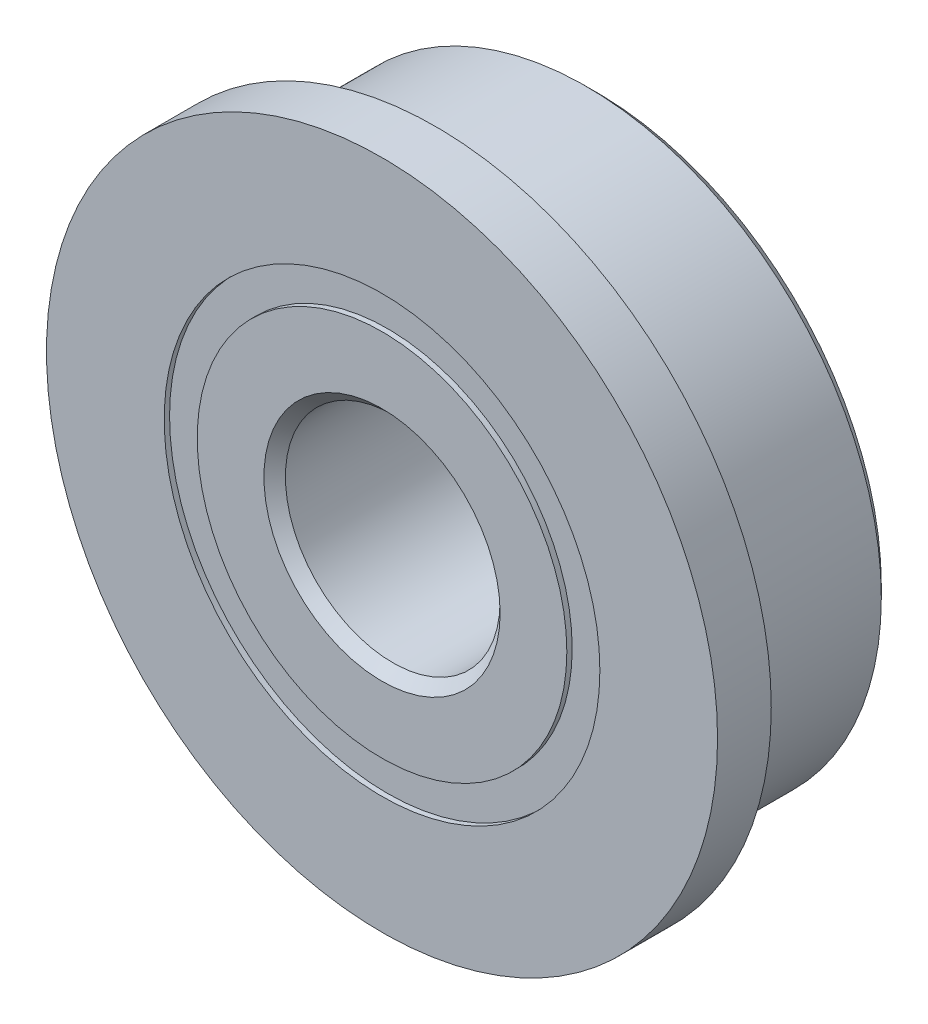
ISO-10303-21;
HEADER;
FILE_DESCRIPTION(('STEP AP214'),'2;1');
FILE_NAME('part.step','',(''),(''),'','','');
FILE_SCHEMA(('AUTOMOTIVE_DESIGN { 1 0 10303 214 1 1 1 1 }'));
ENDSEC;
DATA;
#1=APPLICATION_CONTEXT('core data for automotive mechanical design processes');
#2=APPLICATION_PROTOCOL_DEFINITION('international standard','automotive_design',2000,#1);
#3=PRODUCT_CONTEXT('',#1,'mechanical');
#4=PRODUCT('Part','Part','',(#3));
#5=PRODUCT_RELATED_PRODUCT_CATEGORY('part','',(#4));
#6=PRODUCT_DEFINITION_FORMATION('','',#4);
#7=PRODUCT_DEFINITION_CONTEXT('part definition',#1,'design');
#8=PRODUCT_DEFINITION('design','',#6,#7);
#9=PRODUCT_DEFINITION_SHAPE('','',#8);
#10=(LENGTH_UNIT() NAMED_UNIT(*) SI_UNIT(.MILLI.,.METRE.));
#11=(NAMED_UNIT(*) PLANE_ANGLE_UNIT() SI_UNIT($,.RADIAN.));
#12=(NAMED_UNIT(*) SI_UNIT($,.STERADIAN.) SOLID_ANGLE_UNIT());
#13=UNCERTAINTY_MEASURE_WITH_UNIT(LENGTH_MEASURE(1.E-05),#10,'distance_accuracy_value','');
#14=(GEOMETRIC_REPRESENTATION_CONTEXT(3) GLOBAL_UNCERTAINTY_ASSIGNED_CONTEXT((#13)) GLOBAL_UNIT_ASSIGNED_CONTEXT((#10,
#11,#12)) REPRESENTATION_CONTEXT('',''));
#15=CARTESIAN_POINT('',(0.,0.,0.));
#16=DIRECTION('',(0.,0.,1.));
#17=DIRECTION('',(1.,0.,0.));
#18=AXIS2_PLACEMENT_3D('',#15,#16,#17);
#19=CARTESIAN_POINT('',(0.,4.05769230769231,-1.9));
#20=DIRECTION('',(0.,0.,1.));
#21=DIRECTION('',(1.,0.,0.));
#22=AXIS2_PLACEMENT_3D('',#19,#20,#21);
#23=PLANE('',#22);
#24=CARTESIAN_POINT('',(0.,0.,-1.9));
#25=DIRECTION('',(0.,0.,1.));
#26=DIRECTION('',(1.,0.,0.));
#27=AXIS2_PLACEMENT_3D('',#24,#25,#26);
#28=CIRCLE('',#27,4.05769230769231);
#29=CARTESIAN_POINT('',(4.05769230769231,0.,-1.9));
#30=VERTEX_POINT('',#29);
#31=EDGE_CURVE('E66',#30,#30,#28,.T.);
#32=ORIENTED_EDGE('',*,*,#31,.F.);
#33=EDGE_LOOP('',(#32));
#34=FACE_BOUND('',#33,.T.);
#35=CARTESIAN_POINT('',(0.,0.,-1.9));
#36=DIRECTION('',(0.,0.,1.));
#37=DIRECTION('',(1.,0.,0.));
#38=AXIS2_PLACEMENT_3D('',#35,#36,#37);
#39=CIRCLE('',#38,3.44230769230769);
#40=CARTESIAN_POINT('',(3.44230769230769,0.,-1.9));
#41=VERTEX_POINT('',#40);
#42=EDGE_CURVE('E11',#41,#41,#39,.T.);
#43=ORIENTED_EDGE('',*,*,#42,.T.);
#44=EDGE_LOOP('',(#43));
#45=FACE_BOUND('',#44,.T.);
#46=ADVANCED_FACE('F52',(#34,#45),#23,.F.);
#47=CARTESIAN_POINT('',(0.,0.,2.));
#48=DIRECTION('',(0.,0.,1.));
#49=DIRECTION('',(1.,0.,0.));
#50=AXIS2_PLACEMENT_3D('',#47,#48,#49);
#51=CYLINDRICAL_SURFACE('',#50,3.44230769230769);
#52=ORIENTED_EDGE('',*,*,#42,.F.);
#53=EDGE_LOOP('',(#52));
#54=FACE_BOUND('',#53,.T.);
#55=CARTESIAN_POINT('',(0.,0.,-0.940637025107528));
#56=DIRECTION('',(0.,0.,1.));
#57=DIRECTION('',(1.,0.,0.));
#58=AXIS2_PLACEMENT_3D('',#55,#56,#57);
#59=CIRCLE('',#58,3.44230769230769);
#60=CARTESIAN_POINT('',(3.44230769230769,0.,-0.940637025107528));
#61=VERTEX_POINT('',#60);
#62=EDGE_CURVE('E58',#61,#61,#59,.T.);
#63=ORIENTED_EDGE('',*,*,#62,.T.);
#64=EDGE_LOOP('',(#63));
#65=FACE_BOUND('',#64,.T.);
#66=ADVANCED_FACE('F75',(#54,#65),#51,.F.);
#67=CARTESIAN_POINT('',(0.,4.05769230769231,-0.940637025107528));
#68=DIRECTION('',(0.,0.,-1.));
#69=DIRECTION('',(-1.,0.,0.));
#70=AXIS2_PLACEMENT_3D('',#67,#68,#69);
#71=PLANE('',#70);
#72=ORIENTED_EDGE('',*,*,#62,.F.);
#73=EDGE_LOOP('',(#72));
#74=FACE_BOUND('',#73,.T.);
#75=CARTESIAN_POINT('',(0.,0.,-0.940637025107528));
#76=DIRECTION('',(0.,0.,1.));
#77=DIRECTION('',(1.,0.,0.));
#78=AXIS2_PLACEMENT_3D('',#75,#76,#77);
#79=CIRCLE('',#78,4.05769230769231);
#80=CARTESIAN_POINT('',(4.05769230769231,0.,-0.940637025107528));
#81=VERTEX_POINT('',#80);
#82=EDGE_CURVE('E62',#81,#81,#79,.T.);
#83=ORIENTED_EDGE('',*,*,#82,.T.);
#84=EDGE_LOOP('',(#83));
#85=FACE_BOUND('',#84,.T.);
#86=ADVANCED_FACE('F79',(#74,#85),#71,.F.);
#87=CARTESIAN_POINT('',(0.,0.,2.));
#88=DIRECTION('',(0.,0.,1.));
#89=DIRECTION('',(1.,0.,0.));
#90=AXIS2_PLACEMENT_3D('',#87,#88,#89);
#91=CYLINDRICAL_SURFACE('',#90,4.05769230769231);
#92=ORIENTED_EDGE('',*,*,#82,.F.);
#93=EDGE_LOOP('',(#92));
#94=FACE_BOUND('',#93,.T.);
#95=ORIENTED_EDGE('',*,*,#31,.T.);
#96=EDGE_LOOP('',(#95));
#97=FACE_BOUND('',#96,.T.);
#98=ADVANCED_FACE('F72',(#94,#97),#91,.T.);
#99=CLOSED_SHELL('',(#46,#66,#86,#98));
#100=MANIFOLD_SOLID_BREP('B2',#99);
#101=CARTESIAN_POINT('',(-1.87499999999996,3.24759526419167,0.));
#102=DIRECTION('',(0.,0.,1.));
#103=DIRECTION('',(-0.499999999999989,0.866025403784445,0.));
#104=AXIS2_PLACEMENT_3D('',#101,#102,#103);
#105=SPHERICAL_SURFACE('',#104,0.940637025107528);
#106=CARTESIAN_POINT('',(-1.87499999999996,3.24759526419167,0.940637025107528));
#107=VERTEX_POINT('',#106);
#108=VERTEX_LOOP('',#107);
#109=FACE_BOUND('',#108,.T.);
#110=ADVANCED_FACE('F120',(#109),#105,.T.);
#111=CLOSED_SHELL('',(#110));
#112=MANIFOLD_SOLID_BREP('B6',#111);
#113=CARTESIAN_POINT('',(-3.24759526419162,1.87500000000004,0.));
#114=DIRECTION('',(0.,0.,1.));
#115=DIRECTION('',(-0.866025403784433,0.50000000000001,0.));
#116=AXIS2_PLACEMENT_3D('',#113,#114,#115);
#117=SPHERICAL_SURFACE('',#116,0.940637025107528);
#118=CARTESIAN_POINT('',(-3.24759526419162,1.87500000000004,0.940637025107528));
#119=VERTEX_POINT('',#118);
#120=VERTEX_LOOP('',#119);
#121=FACE_BOUND('',#120,.T.);
#122=ADVANCED_FACE('F145',(#121),#117,.T.);
#123=CLOSED_SHELL('',(#122));
#124=MANIFOLD_SOLID_BREP('B48',#123);
#125=CARTESIAN_POINT('',(-3.75,0.,0.));
#126=DIRECTION('',(0.,0.,1.));
#127=DIRECTION('',(-1.,0.,0.));
#128=AXIS2_PLACEMENT_3D('',#125,#126,#127);
#129=SPHERICAL_SURFACE('',#128,0.940637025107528);
#130=CARTESIAN_POINT('',(-3.75,0.,0.940637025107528));
#131=VERTEX_POINT('',#130);
#132=VERTEX_LOOP('',#131);
#133=FACE_BOUND('',#132,.T.);
#134=ADVANCED_FACE('F170',(#133),#129,.T.);
#135=CLOSED_SHELL('',(#134));
#136=MANIFOLD_SOLID_BREP('B116',#135);
#137=CARTESIAN_POINT('',(-3.24759526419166,-1.87499999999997,0.));
#138=DIRECTION('',(0.,0.,1.));
#139=DIRECTION('',(-0.866025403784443,-0.499999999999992,0.));
#140=AXIS2_PLACEMENT_3D('',#137,#138,#139);
#141=SPHERICAL_SURFACE('',#140,0.940637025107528);
#142=CARTESIAN_POINT('',(-3.24759526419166,-1.87499999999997,0.940637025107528));
#143=VERTEX_POINT('',#142);
#144=VERTEX_LOOP('',#143);
#145=FACE_BOUND('',#144,.T.);
#146=ADVANCED_FACE('F195',(#145),#141,.T.);
#147=CLOSED_SHELL('',(#146));
#148=MANIFOLD_SOLID_BREP('B141',#147);
#149=CARTESIAN_POINT('',(-1.87500000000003,-3.24759526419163,0.));
#150=DIRECTION('',(0.,0.,1.));
#151=DIRECTION('',(-0.500000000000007,-0.866025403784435,0.));
#152=AXIS2_PLACEMENT_3D('',#149,#150,#151);
#153=SPHERICAL_SURFACE('',#152,0.940637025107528);
#154=CARTESIAN_POINT('',(-1.87500000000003,-3.24759526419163,0.940637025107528));
#155=VERTEX_POINT('',#154);
#156=VERTEX_LOOP('',#155);
#157=FACE_BOUND('',#156,.T.);
#158=ADVANCED_FACE('F220',(#157),#153,.T.);
#159=CLOSED_SHELL('',(#158));
#160=MANIFOLD_SOLID_BREP('B166',#159);
#161=CARTESIAN_POINT('',(0.,-3.75,0.));
#162=DIRECTION('',(0.,0.,1.));
#163=DIRECTION('',(0.,-1.,0.));
#164=AXIS2_PLACEMENT_3D('',#161,#162,#163);
#165=SPHERICAL_SURFACE('',#164,0.940637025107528);
#166=CARTESIAN_POINT('',(0.,-3.75,0.940637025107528));
#167=VERTEX_POINT('',#166);
#168=VERTEX_LOOP('',#167);
#169=FACE_BOUND('',#168,.T.);
#170=ADVANCED_FACE('F245',(#169),#165,.T.);
#171=CLOSED_SHELL('',(#170));
#172=MANIFOLD_SOLID_BREP('B191',#171);
#173=CARTESIAN_POINT('',(1.87499999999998,-3.24759526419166,0.));
#174=DIRECTION('',(0.,0.,1.));
#175=DIRECTION('',(0.499999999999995,-0.866025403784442,0.));
#176=AXIS2_PLACEMENT_3D('',#173,#174,#175);
#177=SPHERICAL_SURFACE('',#176,0.940637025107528);
#178=CARTESIAN_POINT('',(1.87499999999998,-3.24759526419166,0.940637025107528));
#179=VERTEX_POINT('',#178);
#180=VERTEX_LOOP('',#179);
#181=FACE_BOUND('',#180,.T.);
#182=ADVANCED_FACE('F270',(#181),#177,.T.);
#183=CLOSED_SHELL('',(#182));
#184=MANIFOLD_SOLID_BREP('B216',#183);
#185=CARTESIAN_POINT('',(3.24759526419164,-1.87500000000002,0.));
#186=DIRECTION('',(0.,0.,1.));
#187=DIRECTION('',(0.866025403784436,-0.500000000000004,0.));
#188=AXIS2_PLACEMENT_3D('',#185,#186,#187);
#189=SPHERICAL_SURFACE('',#188,0.940637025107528);
#190=CARTESIAN_POINT('',(3.24759526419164,-1.87500000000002,0.940637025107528));
#191=VERTEX_POINT('',#190);
#192=VERTEX_LOOP('',#191);
#193=FACE_BOUND('',#192,.T.);
#194=ADVANCED_FACE('F295',(#193),#189,.T.);
#195=CLOSED_SHELL('',(#194));
#196=MANIFOLD_SOLID_BREP('B241',#195);
#197=CARTESIAN_POINT('',(3.75,0.,0.));
#198=DIRECTION('',(0.,0.,1.));
#199=DIRECTION('',(1.,0.,0.));
#200=AXIS2_PLACEMENT_3D('',#197,#198,#199);
#201=SPHERICAL_SURFACE('',#200,0.940637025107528);
#202=CARTESIAN_POINT('',(3.75,0.,0.940637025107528));
#203=VERTEX_POINT('',#202);
#204=VERTEX_LOOP('',#203);
#205=FACE_BOUND('',#204,.T.);
#206=ADVANCED_FACE('F320',(#205),#201,.T.);
#207=CLOSED_SHELL('',(#206));
#208=MANIFOLD_SOLID_BREP('B266',#207);
#209=CARTESIAN_POINT('',(3.24759526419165,1.87499999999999,0.));
#210=DIRECTION('',(0.,0.,1.));
#211=DIRECTION('',(0.86602540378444,0.499999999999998,0.));
#212=AXIS2_PLACEMENT_3D('',#209,#210,#211);
#213=SPHERICAL_SURFACE('',#212,0.940637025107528);
#214=CARTESIAN_POINT('',(3.24759526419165,1.87499999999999,0.940637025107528));
#215=VERTEX_POINT('',#214);
#216=VERTEX_LOOP('',#215);
#217=FACE_BOUND('',#216,.T.);
#218=ADVANCED_FACE('F345',(#217),#213,.T.);
#219=CLOSED_SHELL('',(#218));
#220=MANIFOLD_SOLID_BREP('B291',#219);
#221=CARTESIAN_POINT('',(1.875,3.24759526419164,0.));
#222=DIRECTION('',(0.,0.,1.));
#223=DIRECTION('',(0.500000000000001,0.866025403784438,0.));
#224=AXIS2_PLACEMENT_3D('',#221,#222,#223);
#225=SPHERICAL_SURFACE('',#224,0.940637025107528);
#226=CARTESIAN_POINT('',(1.875,3.24759526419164,0.940637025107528));
#227=VERTEX_POINT('',#226);
#228=VERTEX_LOOP('',#227);
#229=FACE_BOUND('',#228,.T.);
#230=ADVANCED_FACE('F370',(#229),#225,.T.);
#231=CLOSED_SHELL('',(#230));
#232=MANIFOLD_SOLID_BREP('B316',#231);
#233=CARTESIAN_POINT('',(0.,3.75,0.));
#234=DIRECTION('',(0.,0.,1.));
#235=DIRECTION('',(0.,1.,0.));
#236=AXIS2_PLACEMENT_3D('',#233,#234,#235);
#237=SPHERICAL_SURFACE('',#236,0.940637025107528);
#238=CARTESIAN_POINT('',(0.,3.75,0.940637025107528));
#239=VERTEX_POINT('',#238);
#240=VERTEX_LOOP('',#239);
#241=FACE_BOUND('',#240,.T.);
#242=ADVANCED_FACE('F396',(#241),#237,.T.);
#243=CLOSED_SHELL('',(#242));
#244=MANIFOLD_SOLID_BREP('B341',#243);
#245=CARTESIAN_POINT('',(0.,0.,2.));
#246=DIRECTION('',(0.,0.,1.));
#247=DIRECTION('',(1.,0.,0.));
#248=AXIS2_PLACEMENT_3D('',#245,#246,#247);
#249=CYLINDRICAL_SURFACE('',#248,4.05769230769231);
#250=CARTESIAN_POINT('',(0.,0.,2.));
#251=DIRECTION('',(0.,0.,1.));
#252=DIRECTION('',(1.,0.,0.));
#253=AXIS2_PLACEMENT_3D('',#250,#251,#252);
#254=CIRCLE('',#253,4.05769230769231);
#255=CARTESIAN_POINT('',(4.05769230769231,0.,2.));
#256=VERTEX_POINT('',#255);
#257=EDGE_CURVE('E441',#256,#256,#254,.T.);
#258=ORIENTED_EDGE('',*,*,#257,.T.);
#259=EDGE_LOOP('',(#258));
#260=FACE_BOUND('',#259,.T.);
#261=CARTESIAN_POINT('',(0.,0.,1.9));
#262=DIRECTION('',(0.,0.,-1.));
#263=DIRECTION('',(-1.,0.,0.));
#264=AXIS2_PLACEMENT_3D('',#261,#262,#263);
#265=CIRCLE('',#264,4.05769230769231);
#266=CARTESIAN_POINT('',(-4.05769230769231,0.,1.9));
#267=VERTEX_POINT('',#266);
#268=EDGE_CURVE('E395',#267,#267,#265,.F.);
#269=ORIENTED_EDGE('',*,*,#268,.F.);
#270=EDGE_LOOP('',(#269));
#271=FACE_BOUND('',#270,.T.);
#272=ADVANCED_FACE('F409',(#260,#271),#249,.F.);
#273=CARTESIAN_POINT('',(0.,0.,0.888888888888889));
#274=DIRECTION('',(0.,0.,1.));
#275=DIRECTION('',(1.,0.,0.));
#276=AXIS2_PLACEMENT_3D('',#273,#274,#275);
#277=CIRCLE('',#276,4.05769230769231);
#278=CARTESIAN_POINT('',(4.05769230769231,0.,0.888888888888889));
#279=VERTEX_POINT('',#278);
#280=EDGE_CURVE('E438',#279,#279,#277,.T.);
#281=ORIENTED_EDGE('',*,*,#280,.F.);
#282=EDGE_LOOP('',(#281));
#283=FACE_BOUND('',#282,.T.);
#284=CARTESIAN_POINT('',(0.,0.,0.940637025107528));
#285=DIRECTION('',(0.,0.,1.));
#286=DIRECTION('',(1.,0.,0.));
#287=AXIS2_PLACEMENT_3D('',#284,#285,#286);
#288=CIRCLE('',#287,4.05769230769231);
#289=CARTESIAN_POINT('',(4.05769230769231,0.,0.940637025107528));
#290=VERTEX_POINT('',#289);
#291=EDGE_CURVE('E416',#290,#290,#288,.F.);
#292=ORIENTED_EDGE('',*,*,#291,.F.);
#293=EDGE_LOOP('',(#292));
#294=FACE_BOUND('',#293,.T.);
#295=ADVANCED_FACE('F511',(#283,#294),#249,.F.);
#296=CARTESIAN_POINT('',(0.,0.,2.));
#297=DIRECTION('',(0.,0.,1.));
#298=DIRECTION('',(1.,0.,0.));
#299=AXIS2_PLACEMENT_3D('',#296,#297,#298);
#300=CYLINDRICAL_SURFACE('',#299,5.5);
#301=CARTESIAN_POINT('',(0.,0.,-1.8));
#302=DIRECTION('',(0.,0.,1.));
#303=DIRECTION('',(1.,0.,0.));
#304=AXIS2_PLACEMENT_3D('',#301,#302,#303);
#305=CIRCLE('',#304,5.5);
#306=CARTESIAN_POINT('',(5.5,0.,-1.8));
#307=VERTEX_POINT('',#306);
#308=EDGE_CURVE('E424',#307,#307,#305,.T.);
#309=ORIENTED_EDGE('',*,*,#308,.T.);
#310=EDGE_LOOP('',(#309));
#311=FACE_BOUND('',#310,.T.);
#312=CARTESIAN_POINT('',(0.,0.,1.));
#313=DIRECTION('',(0.,0.,1.));
#314=DIRECTION('',(1.,0.,0.));
#315=AXIS2_PLACEMENT_3D('',#312,#313,#314);
#316=CIRCLE('',#315,5.5);
#317=CARTESIAN_POINT('',(5.5,0.,1.));
#318=VERTEX_POINT('',#317);
#319=EDGE_CURVE('E420',#318,#318,#316,.T.);
#320=ORIENTED_EDGE('',*,*,#319,.F.);
#321=EDGE_LOOP('',(#320));
#322=FACE_BOUND('',#321,.T.);
#323=ADVANCED_FACE('F411',(#311,#322),#300,.T.);
#324=CARTESIAN_POINT('',(0.,0.,-2.));
#325=DIRECTION('',(0.,0.,1.));
#326=DIRECTION('',(1.,0.,0.));
#327=AXIS2_PLACEMENT_3D('',#324,#325,#326);
#328=CONICAL_SURFACE('',#327,5.3,0.78539816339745);
#329=ORIENTED_EDGE('',*,*,#308,.F.);
#330=EDGE_LOOP('',(#329));
#331=FACE_BOUND('',#330,.T.);
#332=CARTESIAN_POINT('',(0.,0.,-2.));
#333=DIRECTION('',(0.,0.,1.));
#334=DIRECTION('',(1.,0.,0.));
#335=AXIS2_PLACEMENT_3D('',#332,#333,#334);
#336=CIRCLE('',#335,5.3);
#337=CARTESIAN_POINT('',(5.3,0.,-2.));
#338=VERTEX_POINT('',#337);
#339=EDGE_CURVE('E429',#338,#338,#336,.T.);
#340=ORIENTED_EDGE('',*,*,#339,.T.);
#341=EDGE_LOOP('',(#340));
#342=FACE_BOUND('',#341,.T.);
#343=ADVANCED_FACE('F533',(#331,#342),#328,.T.);
#344=CARTESIAN_POINT('',(0.,5.3,-2.));
#345=DIRECTION('',(0.,0.,1.));
#346=DIRECTION('',(1.,0.,0.));
#347=AXIS2_PLACEMENT_3D('',#344,#345,#346);
#348=PLANE('',#347);
#349=ORIENTED_EDGE('',*,*,#339,.F.);
#350=EDGE_LOOP('',(#349));
#351=FACE_BOUND('',#350,.T.);
#352=CARTESIAN_POINT('',(0.,0.,-2.));
#353=DIRECTION('',(0.,0.,1.));
#354=DIRECTION('',(1.,0.,0.));
#355=AXIS2_PLACEMENT_3D('',#352,#353,#354);
#356=CIRCLE('',#355,4.05769230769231);
#357=CARTESIAN_POINT('',(4.05769230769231,0.,-2.));
#358=VERTEX_POINT('',#357);
#359=EDGE_CURVE('E432',#358,#358,#356,.T.);
#360=ORIENTED_EDGE('',*,*,#359,.T.);
#361=EDGE_LOOP('',(#360));
#362=FACE_BOUND('',#361,.T.);
#363=ADVANCED_FACE('F530',(#351,#362),#348,.F.);
#364=CARTESIAN_POINT('',(0.,0.,2.));
#365=DIRECTION('',(0.,0.,1.));
#366=DIRECTION('',(1.,0.,0.));
#367=AXIS2_PLACEMENT_3D('',#364,#365,#366);
#368=CYLINDRICAL_SURFACE('',#367,4.05769230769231);
#369=ORIENTED_EDGE('',*,*,#359,.F.);
#370=EDGE_LOOP('',(#369));
#371=FACE_BOUND('',#370,.T.);
#372=CARTESIAN_POINT('',(0.,0.,-0.888888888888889));
#373=DIRECTION('',(0.,0.,1.));
#374=DIRECTION('',(1.,0.,0.));
#375=AXIS2_PLACEMENT_3D('',#372,#373,#374);
#376=CIRCLE('',#375,4.05769230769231);
#377=CARTESIAN_POINT('',(4.05769230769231,0.,-0.888888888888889));
#378=VERTEX_POINT('',#377);
#379=EDGE_CURVE('E435',#378,#378,#376,.T.);
#380=ORIENTED_EDGE('',*,*,#379,.T.);
#381=EDGE_LOOP('',(#380));
#382=FACE_BOUND('',#381,.T.);
#383=ADVANCED_FACE('F526',(#371,#382),#368,.F.);
#384=CARTESIAN_POINT('',(0.,0.,0.));
#385=DIRECTION('',(0.,0.,1.));
#386=DIRECTION('',(1.,0.,0.));
#387=AXIS2_PLACEMENT_3D('',#384,#385,#386);
#388=TOROIDAL_SURFACE('',#387,3.75,0.940637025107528);
#389=ORIENTED_EDGE('',*,*,#379,.F.);
#390=EDGE_LOOP('',(#389));
#391=FACE_BOUND('',#390,.T.);
#392=ORIENTED_EDGE('',*,*,#280,.T.);
#393=EDGE_LOOP('',(#392));
#394=FACE_BOUND('',#393,.T.);
#395=ADVANCED_FACE('F524',(#391,#394),#388,.F.);
#396=CARTESIAN_POINT('',(0.,5.3,2.));
#397=DIRECTION('',(0.,0.,-1.));
#398=DIRECTION('',(-1.,0.,0.));
#399=AXIS2_PLACEMENT_3D('',#396,#397,#398);
#400=PLANE('',#399);
#401=ORIENTED_EDGE('',*,*,#257,.F.);
#402=EDGE_LOOP('',(#401));
#403=FACE_BOUND('',#402,.T.);
#404=CARTESIAN_POINT('',(0.,0.,2.));
#405=DIRECTION('',(0.,0.,1.));
#406=DIRECTION('',(1.,0.,0.));
#407=AXIS2_PLACEMENT_3D('',#404,#405,#406);
#408=CIRCLE('',#407,6.25);
#409=CARTESIAN_POINT('',(6.25,0.,2.));
#410=VERTEX_POINT('',#409);
#411=EDGE_CURVE('E445',#410,#410,#408,.T.);
#412=ORIENTED_EDGE('',*,*,#411,.T.);
#413=EDGE_LOOP('',(#412));
#414=FACE_BOUND('',#413,.T.);
#415=ADVANCED_FACE('F522',(#403,#414),#400,.F.);
#416=CARTESIAN_POINT('',(0.,0.,1.));
#417=DIRECTION('',(0.,0.,1.));
#418=DIRECTION('',(1.,0.,0.));
#419=AXIS2_PLACEMENT_3D('',#416,#417,#418);
#420=CYLINDRICAL_SURFACE('',#419,6.25);
#421=CARTESIAN_POINT('',(0.,0.,1.));
#422=DIRECTION('',(0.,0.,1.));
#423=DIRECTION('',(1.,0.,0.));
#424=AXIS2_PLACEMENT_3D('',#421,#422,#423);
#425=CIRCLE('',#424,6.25);
#426=CARTESIAN_POINT('',(6.25,0.,1.));
#427=VERTEX_POINT('',#426);
#428=EDGE_CURVE('E444',#427,#427,#425,.T.);
#429=ORIENTED_EDGE('',*,*,#428,.T.);
#430=EDGE_LOOP('',(#429));
#431=FACE_BOUND('',#430,.T.);
#432=ORIENTED_EDGE('',*,*,#411,.F.);
#433=EDGE_LOOP('',(#432));
#434=FACE_BOUND('',#433,.T.);
#435=ADVANCED_FACE('F507',(#431,#434),#420,.T.);
#436=CARTESIAN_POINT('',(0.,0.,1.));
#437=DIRECTION('',(0.,0.,1.));
#438=DIRECTION('',(1.,0.,0.));
#439=AXIS2_PLACEMENT_3D('',#436,#437,#438);
#440=PLANE('',#439);
#441=ORIENTED_EDGE('',*,*,#319,.T.);
#442=EDGE_LOOP('',(#441));
#443=FACE_BOUND('',#442,.T.);
#444=ORIENTED_EDGE('',*,*,#428,.F.);
#445=EDGE_LOOP('',(#444));
#446=FACE_BOUND('',#445,.T.);
#447=ADVANCED_FACE('F500',(#443,#446),#440,.F.);
#448=CARTESIAN_POINT('',(0.,4.05769230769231,1.9));
#449=DIRECTION('',(0.,0.,-1.));
#450=DIRECTION('',(-1.,0.,0.));
#451=AXIS2_PLACEMENT_3D('',#448,#449,#450);
#452=PLANE('',#451);
#453=CARTESIAN_POINT('',(0.,0.,1.9));
#454=DIRECTION('',(0.,0.,1.));
#455=DIRECTION('',(1.,0.,0.));
#456=AXIS2_PLACEMENT_3D('',#453,#454,#455);
#457=CIRCLE('',#456,3.44230769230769);
#458=CARTESIAN_POINT('',(3.44230769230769,0.,1.9));
#459=VERTEX_POINT('',#458);
#460=EDGE_CURVE('E448',#459,#459,#457,.T.);
#461=ORIENTED_EDGE('',*,*,#460,.F.);
#462=EDGE_LOOP('',(#461));
#463=FACE_BOUND('',#462,.T.);
#464=ORIENTED_EDGE('',*,*,#268,.T.);
#465=EDGE_LOOP('',(#464));
#466=FACE_BOUND('',#465,.T.);
#467=ADVANCED_FACE('F498',(#463,#466),#452,.F.);
#468=CARTESIAN_POINT('',(0.,4.05769230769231,0.940637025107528));
#469=DIRECTION('',(0.,0.,1.));
#470=DIRECTION('',(1.,0.,0.));
#471=AXIS2_PLACEMENT_3D('',#468,#469,#470);
#472=PLANE('',#471);
#473=ORIENTED_EDGE('',*,*,#291,.T.);
#474=EDGE_LOOP('',(#473));
#475=FACE_BOUND('',#474,.T.);
#476=CARTESIAN_POINT('',(0.,0.,0.940637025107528));
#477=DIRECTION('',(0.,0.,1.));
#478=DIRECTION('',(1.,0.,0.));
#479=AXIS2_PLACEMENT_3D('',#476,#477,#478);
#480=CIRCLE('',#479,3.44230769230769);
#481=CARTESIAN_POINT('',(3.44230769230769,0.,0.940637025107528));
#482=VERTEX_POINT('',#481);
#483=EDGE_CURVE('E453',#482,#482,#480,.F.);
#484=ORIENTED_EDGE('',*,*,#483,.F.);
#485=EDGE_LOOP('',(#484));
#486=FACE_BOUND('',#485,.T.);
#487=ADVANCED_FACE('F494',(#475,#486),#472,.F.);
#488=CARTESIAN_POINT('',(0.,0.,2.));
#489=DIRECTION('',(0.,0.,1.));
#490=DIRECTION('',(1.,0.,0.));
#491=AXIS2_PLACEMENT_3D('',#488,#489,#490);
#492=CYLINDRICAL_SURFACE('',#491,3.44230769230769);
#493=CARTESIAN_POINT('',(0.,0.,2.));
#494=DIRECTION('',(0.,0.,1.));
#495=DIRECTION('',(1.,0.,0.));
#496=AXIS2_PLACEMENT_3D('',#493,#494,#495);
#497=CIRCLE('',#496,3.44230769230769);
#498=CARTESIAN_POINT('',(3.44230769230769,0.,2.));
#499=VERTEX_POINT('',#498);
#500=EDGE_CURVE('E456',#499,#499,#497,.T.);
#501=ORIENTED_EDGE('',*,*,#500,.F.);
#502=EDGE_LOOP('',(#501));
#503=FACE_BOUND('',#502,.T.);
#504=ORIENTED_EDGE('',*,*,#460,.T.);
#505=EDGE_LOOP('',(#504));
#506=FACE_BOUND('',#505,.T.);
#507=ADVANCED_FACE('F491',(#503,#506),#492,.T.);
#508=CARTESIAN_POINT('',(0.,0.,0.888888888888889));
#509=DIRECTION('',(0.,0.,1.));
#510=DIRECTION('',(1.,0.,0.));
#511=AXIS2_PLACEMENT_3D('',#508,#509,#510);
#512=CIRCLE('',#511,3.44230769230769);
#513=CARTESIAN_POINT('',(3.44230769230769,0.,0.888888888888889));
#514=VERTEX_POINT('',#513);
#515=EDGE_CURVE('E459',#514,#514,#512,.T.);
#516=ORIENTED_EDGE('',*,*,#515,.T.);
#517=EDGE_LOOP('',(#516));
#518=FACE_BOUND('',#517,.T.);
#519=ORIENTED_EDGE('',*,*,#483,.T.);
#520=EDGE_LOOP('',(#519));
#521=FACE_BOUND('',#520,.T.);
#522=ADVANCED_FACE('F487',(#518,#521),#492,.T.);
#523=CARTESIAN_POINT('',(0.,3.44230769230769,2.));
#524=DIRECTION('',(0.,0.,-1.));
#525=DIRECTION('',(-1.,0.,0.));
#526=AXIS2_PLACEMENT_3D('',#523,#524,#525);
#527=PLANE('',#526);
#528=CARTESIAN_POINT('',(0.,0.,2.));
#529=DIRECTION('',(0.,0.,1.));
#530=DIRECTION('',(1.,0.,0.));
#531=AXIS2_PLACEMENT_3D('',#528,#529,#530);
#532=CIRCLE('',#531,2.2);
#533=CARTESIAN_POINT('',(2.2,0.,2.));
#534=VERTEX_POINT('',#533);
#535=EDGE_CURVE('E477',#534,#534,#532,.T.);
#536=ORIENTED_EDGE('',*,*,#535,.F.);
#537=EDGE_LOOP('',(#536));
#538=FACE_BOUND('',#537,.T.);
#539=ORIENTED_EDGE('',*,*,#500,.T.);
#540=EDGE_LOOP('',(#539));
#541=FACE_BOUND('',#540,.T.);
#542=ADVANCED_FACE('F483',(#538,#541),#527,.F.);
#543=CARTESIAN_POINT('',(0.,0.,0.));
#544=DIRECTION('',(0.,0.,1.));
#545=DIRECTION('',(1.,0.,0.));
#546=AXIS2_PLACEMENT_3D('',#543,#544,#545);
#547=TOROIDAL_SURFACE('',#546,3.75,0.940637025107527);
#548=ORIENTED_EDGE('',*,*,#515,.F.);
#549=EDGE_LOOP('',(#548));
#550=FACE_BOUND('',#549,.T.);
#551=CARTESIAN_POINT('',(0.,0.,-0.88888888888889));
#552=DIRECTION('',(0.,0.,1.));
#553=DIRECTION('',(1.,0.,0.));
#554=AXIS2_PLACEMENT_3D('',#551,#552,#553);
#555=CIRCLE('',#554,3.44230769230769);
#556=CARTESIAN_POINT('',(3.44230769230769,0.,-0.88888888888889));
#557=VERTEX_POINT('',#556);
#558=EDGE_CURVE('E462',#557,#557,#555,.T.);
#559=ORIENTED_EDGE('',*,*,#558,.T.);
#560=EDGE_LOOP('',(#559));
#561=FACE_BOUND('',#560,.T.);
#562=ADVANCED_FACE('F486',(#550,#561),#547,.F.);
#563=CARTESIAN_POINT('',(0.,0.,2.));
#564=DIRECTION('',(0.,0.,1.));
#565=DIRECTION('',(1.,0.,0.));
#566=AXIS2_PLACEMENT_3D('',#563,#564,#565);
#567=CYLINDRICAL_SURFACE('',#566,3.44230769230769);
#568=ORIENTED_EDGE('',*,*,#558,.F.);
#569=EDGE_LOOP('',(#568));
#570=FACE_BOUND('',#569,.T.);
#571=CARTESIAN_POINT('',(0.,0.,-2.));
#572=DIRECTION('',(0.,0.,1.));
#573=DIRECTION('',(1.,0.,0.));
#574=AXIS2_PLACEMENT_3D('',#571,#572,#573);
#575=CIRCLE('',#574,3.44230769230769);
#576=CARTESIAN_POINT('',(3.44230769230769,0.,-2.));
#577=VERTEX_POINT('',#576);
#578=EDGE_CURVE('E465',#577,#577,#575,.T.);
#579=ORIENTED_EDGE('',*,*,#578,.T.);
#580=EDGE_LOOP('',(#579));
#581=FACE_BOUND('',#580,.T.);
#582=ADVANCED_FACE('F617',(#570,#581),#567,.T.);
#583=CARTESIAN_POINT('',(0.,2.2,-2.));
#584=DIRECTION('',(0.,0.,1.));
#585=DIRECTION('',(1.,0.,0.));
#586=AXIS2_PLACEMENT_3D('',#583,#584,#585);
#587=PLANE('',#586);
#588=ORIENTED_EDGE('',*,*,#578,.F.);
#589=EDGE_LOOP('',(#588));
#590=FACE_BOUND('',#589,.T.);
#591=CARTESIAN_POINT('',(0.,0.,-2.));
#592=DIRECTION('',(0.,0.,1.));
#593=DIRECTION('',(1.,0.,0.));
#594=AXIS2_PLACEMENT_3D('',#591,#592,#593);
#595=CIRCLE('',#594,2.2);
#596=CARTESIAN_POINT('',(2.2,0.,-2.));
#597=VERTEX_POINT('',#596);
#598=EDGE_CURVE('E468',#597,#597,#595,.T.);
#599=ORIENTED_EDGE('',*,*,#598,.T.);
#600=EDGE_LOOP('',(#599));
#601=FACE_BOUND('',#600,.T.);
#602=ADVANCED_FACE('F607',(#590,#601),#587,.F.);
#603=CARTESIAN_POINT('',(0.,0.,-1.8));
#604=DIRECTION('',(0.,0.,-1.));
#605=DIRECTION('',(-1.,0.,0.));
#606=AXIS2_PLACEMENT_3D('',#603,#604,#605);
#607=CONICAL_SURFACE('',#606,2.,0.785398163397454);
#608=ORIENTED_EDGE('',*,*,#598,.F.);
#609=EDGE_LOOP('',(#608));
#610=FACE_BOUND('',#609,.T.);
#611=CARTESIAN_POINT('',(0.,0.,-1.8));
#612=DIRECTION('',(0.,0.,1.));
#613=DIRECTION('',(1.,0.,0.));
#614=AXIS2_PLACEMENT_3D('',#611,#612,#613);
#615=CIRCLE('',#614,2.);
#616=CARTESIAN_POINT('',(2.,0.,-1.8));
#617=VERTEX_POINT('',#616);
#618=EDGE_CURVE('E471',#617,#617,#615,.T.);
#619=ORIENTED_EDGE('',*,*,#618,.T.);
#620=EDGE_LOOP('',(#619));
#621=FACE_BOUND('',#620,.T.);
#622=ADVANCED_FACE('F597',(#610,#621),#607,.F.);
#623=CARTESIAN_POINT('',(0.,0.,2.));
#624=DIRECTION('',(0.,0.,1.));
#625=DIRECTION('',(1.,0.,0.));
#626=AXIS2_PLACEMENT_3D('',#623,#624,#625);
#627=CYLINDRICAL_SURFACE('',#626,2.);
#628=ORIENTED_EDGE('',*,*,#618,.F.);
#629=EDGE_LOOP('',(#628));
#630=FACE_BOUND('',#629,.T.);
#631=CARTESIAN_POINT('',(0.,0.,1.8));
#632=DIRECTION('',(0.,0.,1.));
#633=DIRECTION('',(1.,0.,0.));
#634=AXIS2_PLACEMENT_3D('',#631,#632,#633);
#635=CIRCLE('',#634,2.);
#636=CARTESIAN_POINT('',(2.,0.,1.8));
#637=VERTEX_POINT('',#636);
#638=EDGE_CURVE('E474',#637,#637,#635,.T.);
#639=ORIENTED_EDGE('',*,*,#638,.T.);
#640=EDGE_LOOP('',(#639));
#641=FACE_BOUND('',#640,.T.);
#642=ADVANCED_FACE('F587',(#630,#641),#627,.F.);
#643=CARTESIAN_POINT('',(0.,0.,2.));
#644=DIRECTION('',(0.,0.,1.));
#645=DIRECTION('',(1.,0.,0.));
#646=AXIS2_PLACEMENT_3D('',#643,#644,#645);
#647=CONICAL_SURFACE('',#646,2.2,0.785398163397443);
#648=ORIENTED_EDGE('',*,*,#638,.F.);
#649=EDGE_LOOP('',(#648));
#650=FACE_BOUND('',#649,.T.);
#651=ORIENTED_EDGE('',*,*,#535,.T.);
#652=EDGE_LOOP('',(#651));
#653=FACE_BOUND('',#652,.T.);
#654=ADVANCED_FACE('F481',(#650,#653),#647,.F.);
#655=CLOSED_SHELL('',(#272,#295,#323,#343,#363,#383,#395,#415,#435,#447,#467,#487,#507,#522,
#542,#562,#582,#602,#622,#642,#654));
#656=MANIFOLD_SOLID_BREP('B366',#655);
#657=ADVANCED_BREP_SHAPE_REPRESENTATION('',(#18,#100,#112,#124,#136,#148,#160,#172,#184,#196,
#208,#220,#232,#244,#656),#14);
#658=SHAPE_DEFINITION_REPRESENTATION(#9,#657);
ENDSEC;
END-ISO-10303-21;
